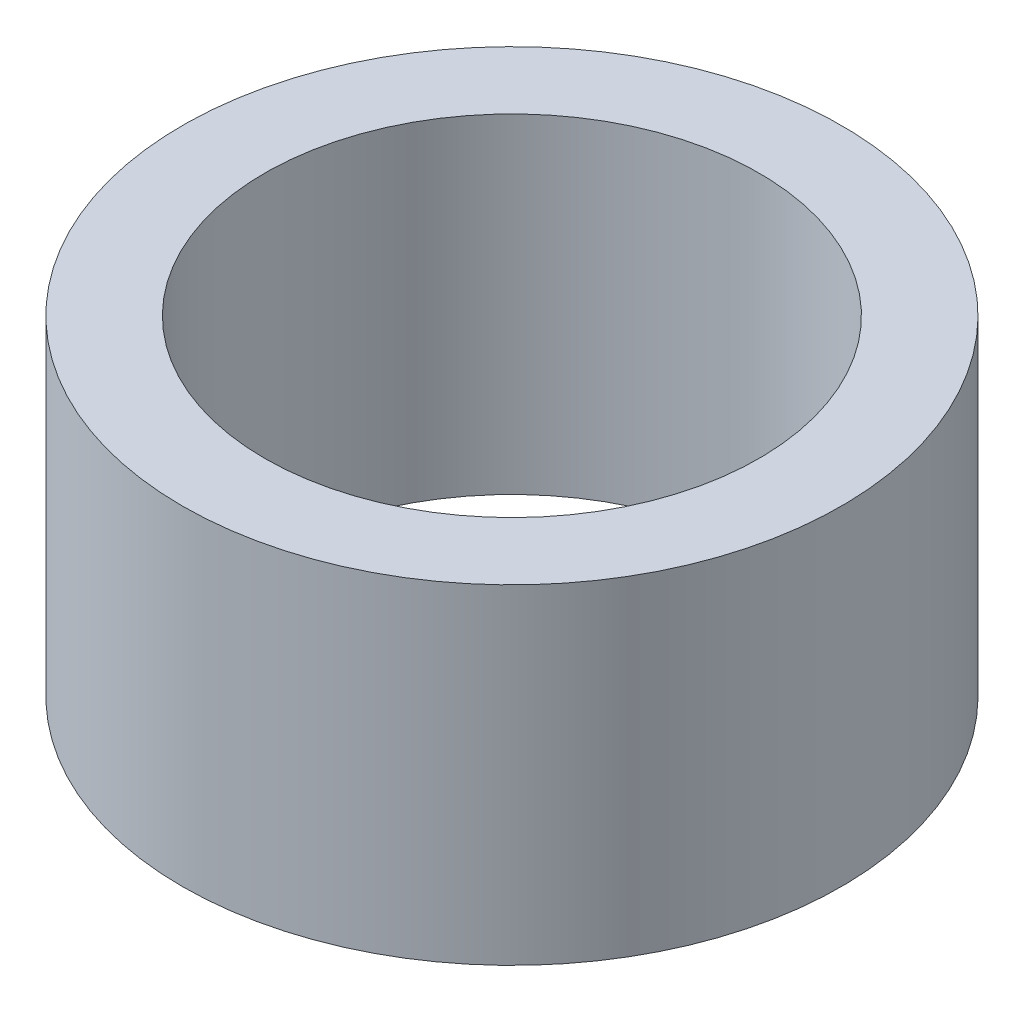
ISO-10303-21;
HEADER;
FILE_DESCRIPTION(('STEP AP214'),'2;1');
FILE_NAME('part.step','',(''),(''),'','','');
FILE_SCHEMA(('AUTOMOTIVE_DESIGN { 1 0 10303 214 1 1 1 1 }'));
ENDSEC;
DATA;
#1=APPLICATION_CONTEXT('core data for automotive mechanical design processes');
#2=APPLICATION_PROTOCOL_DEFINITION('international standard','automotive_design',2000,#1);
#3=PRODUCT_CONTEXT('',#1,'mechanical');
#4=PRODUCT('Part','Part','',(#3));
#5=PRODUCT_RELATED_PRODUCT_CATEGORY('part','',(#4));
#6=PRODUCT_DEFINITION_FORMATION('','',#4);
#7=PRODUCT_DEFINITION_CONTEXT('part definition',#1,'design');
#8=PRODUCT_DEFINITION('design','',#6,#7);
#9=PRODUCT_DEFINITION_SHAPE('','',#8);
#10=(LENGTH_UNIT() NAMED_UNIT(*) SI_UNIT(.MILLI.,.METRE.));
#11=(NAMED_UNIT(*) PLANE_ANGLE_UNIT() SI_UNIT($,.RADIAN.));
#12=(NAMED_UNIT(*) SI_UNIT($,.STERADIAN.) SOLID_ANGLE_UNIT());
#13=UNCERTAINTY_MEASURE_WITH_UNIT(LENGTH_MEASURE(1.E-05),#10,'distance_accuracy_value','');
#14=(GEOMETRIC_REPRESENTATION_CONTEXT(3) GLOBAL_UNCERTAINTY_ASSIGNED_CONTEXT((#13)) GLOBAL_UNIT_ASSIGNED_CONTEXT((#10,
#11,#12)) REPRESENTATION_CONTEXT('',''));
#15=CARTESIAN_POINT('',(0.,0.,0.));
#16=DIRECTION('',(0.,0.,1.));
#17=DIRECTION('',(1.,0.,0.));
#18=AXIS2_PLACEMENT_3D('',#15,#16,#17);
#19=CARTESIAN_POINT('',(0.,6.,0.));
#20=DIRECTION('',(0.,1.,0.));
#21=DIRECTION('',(0.,0.,1.));
#22=AXIS2_PLACEMENT_3D('',#19,#20,#21);
#23=PLANE('',#22);
#24=CARTESIAN_POINT('',(0.,6.,0.));
#25=DIRECTION('',(0.,1.,0.));
#26=DIRECTION('',(0.,0.,1.));
#27=AXIS2_PLACEMENT_3D('',#24,#25,#26);
#28=CIRCLE('',#27,12.);
#29=CARTESIAN_POINT('',(0.,6.,12.));
#30=VERTEX_POINT('',#29);
#31=EDGE_CURVE('E10',#30,#30,#28,.T.);
#32=ORIENTED_EDGE('',*,*,#31,.T.);
#33=EDGE_LOOP('',(#32));
#34=FACE_BOUND('',#33,.T.);
#35=CARTESIAN_POINT('',(0.,6.,0.));
#36=DIRECTION('',(0.,1.,0.));
#37=DIRECTION('',(0.,0.,1.));
#38=AXIS2_PLACEMENT_3D('',#35,#36,#37);
#39=CIRCLE('',#38,9.);
#40=CARTESIAN_POINT('',(0.,6.,9.));
#41=VERTEX_POINT('',#40);
#42=EDGE_CURVE('E43',#41,#41,#39,.T.);
#43=ORIENTED_EDGE('',*,*,#42,.F.);
#44=EDGE_LOOP('',(#43));
#45=FACE_BOUND('',#44,.T.);
#46=ADVANCED_FACE('F32',(#34,#45),#23,.T.);
#47=CARTESIAN_POINT('',(0.,-6.,0.));
#48=DIRECTION('',(0.,1.,0.));
#49=DIRECTION('',(0.,0.,1.));
#50=AXIS2_PLACEMENT_3D('',#47,#48,#49);
#51=PLANE('',#50);
#52=CARTESIAN_POINT('',(0.,-6.,0.));
#53=DIRECTION('',(0.,1.,0.));
#54=DIRECTION('',(0.,0.,1.));
#55=AXIS2_PLACEMENT_3D('',#52,#53,#54);
#56=CIRCLE('',#55,12.);
#57=CARTESIAN_POINT('',(0.,-6.,12.));
#58=VERTEX_POINT('',#57);
#59=EDGE_CURVE('E36',#58,#58,#56,.T.);
#60=ORIENTED_EDGE('',*,*,#59,.F.);
#61=EDGE_LOOP('',(#60));
#62=FACE_BOUND('',#61,.T.);
#63=CARTESIAN_POINT('',(0.,-6.,0.));
#64=DIRECTION('',(0.,1.,0.));
#65=DIRECTION('',(0.,0.,1.));
#66=AXIS2_PLACEMENT_3D('',#63,#64,#65);
#67=CIRCLE('',#66,9.);
#68=CARTESIAN_POINT('',(0.,-6.,9.));
#69=VERTEX_POINT('',#68);
#70=EDGE_CURVE('E45',#69,#69,#67,.T.);
#71=ORIENTED_EDGE('',*,*,#70,.T.);
#72=EDGE_LOOP('',(#71));
#73=FACE_BOUND('',#72,.T.);
#74=ADVANCED_FACE('F55',(#62,#73),#51,.F.);
#75=CARTESIAN_POINT('',(0.,6.,0.));
#76=DIRECTION('',(0.,-1.,0.));
#77=DIRECTION('',(0.,0.,-1.));
#78=AXIS2_PLACEMENT_3D('',#75,#76,#77);
#79=CYLINDRICAL_SURFACE('',#78,12.);
#80=ORIENTED_EDGE('',*,*,#31,.F.);
#81=EDGE_LOOP('',(#80));
#82=FACE_BOUND('',#81,.T.);
#83=ORIENTED_EDGE('',*,*,#59,.T.);
#84=EDGE_LOOP('',(#83));
#85=FACE_BOUND('',#84,.T.);
#86=ADVANCED_FACE('F34',(#82,#85),#79,.T.);
#87=CARTESIAN_POINT('',(0.,6.,0.));
#88=DIRECTION('',(0.,-1.,0.));
#89=DIRECTION('',(0.,0.,-1.));
#90=AXIS2_PLACEMENT_3D('',#87,#88,#89);
#91=CYLINDRICAL_SURFACE('',#90,9.);
#92=ORIENTED_EDGE('',*,*,#42,.T.);
#93=EDGE_LOOP('',(#92));
#94=FACE_BOUND('',#93,.T.);
#95=ORIENTED_EDGE('',*,*,#70,.F.);
#96=EDGE_LOOP('',(#95));
#97=FACE_BOUND('',#96,.T.);
#98=ADVANCED_FACE('F51',(#94,#97),#91,.F.);
#99=CLOSED_SHELL('',(#46,#74,#86,#98));
#100=MANIFOLD_SOLID_BREP('B2',#99);
#101=ADVANCED_BREP_SHAPE_REPRESENTATION('',(#18,#100),#14);
#102=SHAPE_DEFINITION_REPRESENTATION(#9,#101);
ENDSEC;
END-ISO-10303-21;
